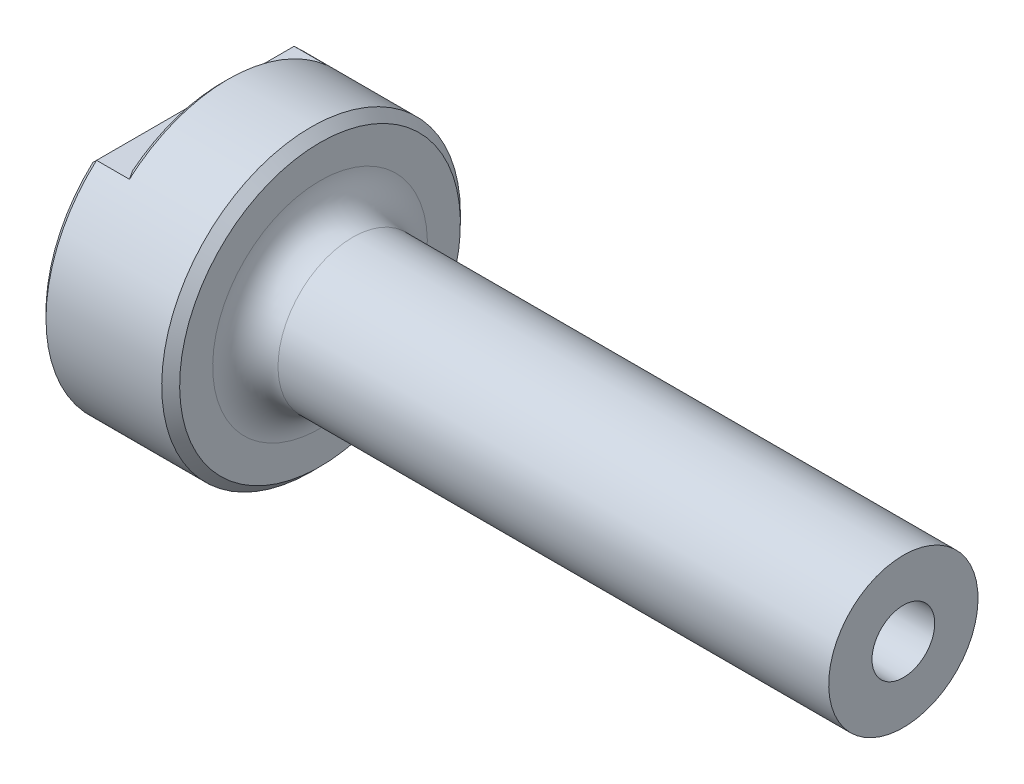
from build123d import *

# Parameters (mm, degrees)
SKETCH1_R           = 25.4
BOSS_EXTRUDE1_DEPTH = 60.721875
SKETCH3_W           = 50.8
SKETCH3_H           = 6.35
CUT_EXTRUDE1_DEPTH  = 5.588
SKETCH5_W           = 99.21875
SKETCH5_H           = 12.7
FILLET1_R           = 5.55625
CHAMFER1_SIZE       = 1.524
CHAMFER2_SIZE       = 1.016


with BuildPart() as part:
    # Sketch1 → Boss-Extrude1 (new, symmetric)
    with BuildSketch(Plane(origin=(0, 0, 0), x_dir=(0, 0, -1), z_dir=(1, 0, 0))):
        with Locations(Location((0, 0, 0), (0, 0, 180))):
            Circle(SKETCH1_R)
    extrude(amount=BOSS_EXTRUDE1_DEPTH, both=True)

    # Sketch3 → Cut-Extrude1 (cut)
    with BuildSketch(Plane.ZY.offset(60.721875)):
        with Locations((0, 22.225)):
            Rectangle(SKETCH3_W, SKETCH3_H)
    extrude(amount=-CUT_EXTRUDE1_DEPTH, mode=Mode.SUBTRACT)

    # Sketch5 → Cut-Revolve1 (revolve, cut)
    with BuildSketch(Plane.XY, mode=Mode.PRIVATE) as cut_revolve1_sk:
        with Locations((11.1125, -19.05)):
            Rectangle(SKETCH5_W, SKETCH5_H)
    revolve(cut_revolve1_sk.sketch.rotate(Axis((60.721875, 0, 0), (-1, 0, 0)), 138.590377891), axis=Axis((60.721875, 0, 0), (-1, 0, 0)), mode=Mode.SUBTRACT)

    # Sketch6 → Cut-Revolve2 (revolve, cut)
    with BuildSketch(Plane.XY):
        with BuildLine():
            Line((-56.099075, 0), (-60.721875, 0))
            Line((-60.721875, 0), (-60.721875, 9.800451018))
            ThreePointArc((-60.721875, 9.800451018), (-57.312769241, 5.418005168), (-56.099075, 0))
        make_face()
    revolve(axis=Axis((60.721875, 0, 0), (-1, 0, 0)), mode=Mode.SUBTRACT)

    # Sketch7 → Cut-Revolve3 (revolve, cut)
    with BuildSketch(Plane.XY):
        Polygon((-56.406657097, 2.778125), (60.721875, 5.333878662), (60.721875, 0), (-56.406657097, 0), align=None)
    revolve(axis=Axis((60.721875, 0, 0), (-1, 0, 0)), mode=Mode.SUBTRACT)

    # Fillet1
    fillet1_edges = [part.edges().sort_by_distance(p)[0] for p in [
        (-38.496875, -9.525, -8.400260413),
    ]]
    fillet(fillet1_edges, radius=FILLET1_R)

    # Chamfer1
    chamfer1_edges = [part.edges().sort_by_distance(p)[0] for p in [
        (-38.496875, 0, -25.4),
    ]]
    chamfer(chamfer1_edges, length=CHAMFER1_SIZE)

    # Chamfer2
    chamfer2_edges = [part.edges().sort_by_distance(p)[0] for p in [
        (-60.721875, -23.150520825, -10.450520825),
        (-60.721875, 19.05, 0),
        (-55.133875, 25.4, 0),
    ]]
    chamfer(chamfer2_edges, length=CHAMFER2_SIZE)


solid = part.part
